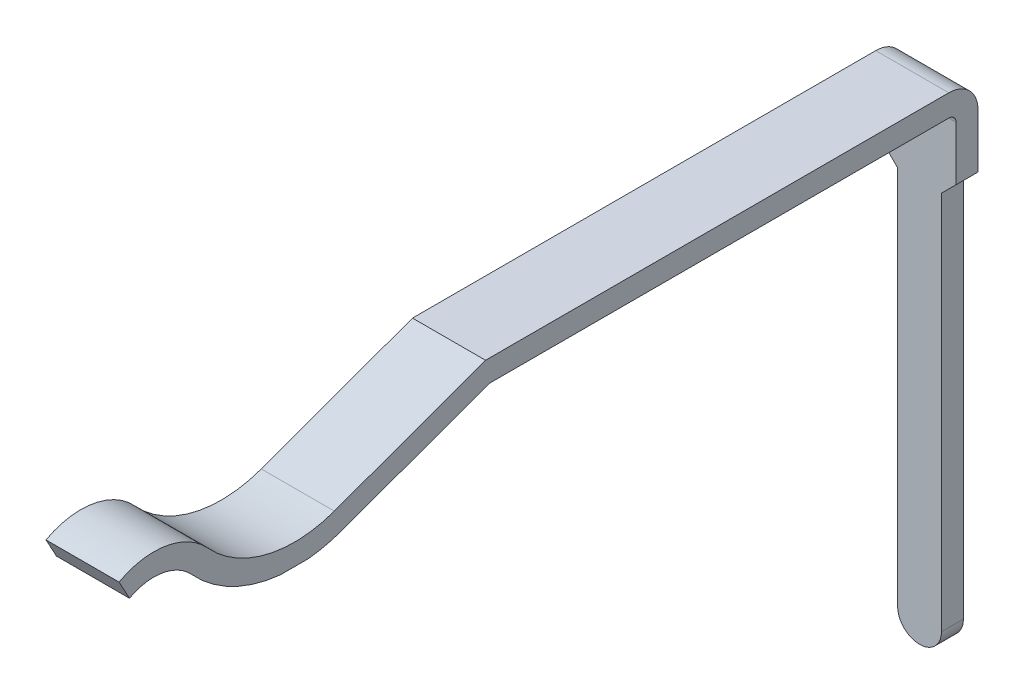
from build123d import *

# Parameters (mm, degrees)
EXTRUDE_THIN1_DEPTH = 0.5
CUT_EXTRUDE1_DEPTH  = 15.486310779


with BuildPart() as part:
    # Sketch1 → Extrude-Thin1 (new, symmetric)
    with BuildSketch(Plane(origin=(0, 0, 0), x_dir=(0, 0, -1), z_dir=(1, 0, 0))):
        with BuildLine():
            ThreePointArc((1, -0.121157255), (1.643863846, -0.014001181), (2.216684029, -0.326923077))
            ThreePointArc((2.216684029, -0.326923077), (3.017058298, -0.803497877), (3.947232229, -0.753508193))
            Line((3.947232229, -0.753508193), (6.017478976, 0))
            Line((6.017478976, 0), (12.36, 0))
            ThreePointArc((12.36, 0), (12.642842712, -0.117157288), (12.76, -0.4))
            Line((12.76, -0.4), (12.76, -6.84))
            Line((12.76, -6.84), (12.46, -6.84))
            Line((12.46, -6.84), (12.46, -0.4))
            ThreePointArc((12.46, -0.4), (12.430710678, -0.329289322), (12.36, -0.3))
            Line((12.36, -0.3), (6.07037707, -0.3))
            Line((6.07037707, -0.3), (4.049838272, -1.035415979))
            ThreePointArc((4.049838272, -1.035415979), (2.945256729, -1.094778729), (1.994812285, -0.528846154))
            ThreePointArc((1.994812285, -0.528846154), (1.593838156, -0.309800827), (1.143133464, -0.384810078))
            Line((1.143133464, -0.384810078), (1, -0.121157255))
        make_face()
    extrude(amount=EXTRUDE_THIN1_DEPTH, both=True)

    # Sketch2 → Cut-Extrude1 (cut, through all)
    with BuildSketch(Plane.XY):
        with BuildLine():
            Line((-0.3, -6.54), (-0.3, -1.34))
            Line((-0.3, -1.34), (-0.5, -1.14))
            Line((-0.5, -1.14), (-0.5, -7.54))
            Line((-0.5, -7.54), (0.5, -7.54))
            Line((0.5, -7.54), (0.5, -1.14))
            Line((0.5, -1.14), (0.3, -1.34))
            Line((0.3, -1.34), (0.3, -6.54))
            ThreePointArc((0.3, -6.54), (0, -6.84), (-0.3, -6.54))
        make_face()
    extrude(amount=-CUT_EXTRUDE1_DEPTH, mode=Mode.SUBTRACT)


solid = part.part
